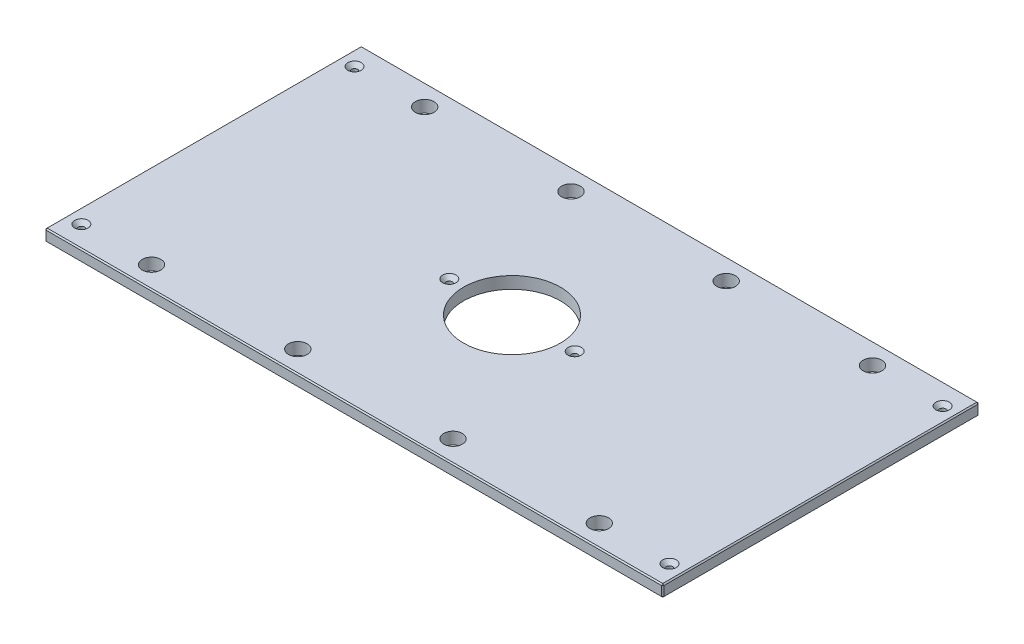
from build123d import *

# Parameters (mm, degrees)
SKETCH1_W                                        = 657.225
SKETCH1_H                                        = 336.55
BOSS_EXTRUDE1_DEPTH                              = 12.7
SKETCH13_R                                       = 51.562
CUT_EXTRUDE6_DEPTH                               = 370.410260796
F_25_32_0_78125_DIAMETER_HOLE1_D                 = 19.84375
CHAMFER2_SIZE                                    = 1.27
CSK_FOR_1_4_FLAT_HEAD_MACHINE_SCREW1_D           = 6.7564
CSK_FOR_1_4_FLAT_HEAD_MACHINE_SCREW1_CSINK_D     = 14.2748
CSK_FOR_1_4_FLAT_HEAD_MACHINE_SCREW1_CSINK_ANGLE = 82


with BuildPart() as part:
    # Sketch1 → Boss-Extrude1 (new body)
    with BuildSketch(Plane(origin=(0, 0, 0), x_dir=(1, 0, 0), z_dir=(0, 1, 0))):
        Rectangle(SKETCH1_W, SKETCH1_H)
    extrude(amount=BOSS_EXTRUDE1_DEPTH)

    # Sketch13 → Cut-Extrude6 (cut, through all)
    with BuildSketch(Plane(origin=(0, 12.7, 0), x_dir=(1, 0, 0), z_dir=(0, 1, 0))):
        with Locations(Location((0, 0, 0), (0, 0, 270))):
            Circle(SKETCH13_R)
    extrude(amount=-CUT_EXTRUDE6_DEPTH, mode=Mode.SUBTRACT)

    # 25_32 _0.78125_ Diameter Hole1 (through all)
    with Locations(Plane(origin=(0, 12.7, 0), x_dir=(1, 0, 0), z_dir=(0, 1, 0))):
        with Locations((238.125, 145.25498), (-238.125, 145.25498), (238.125, -145.25498), (-238.125, -145.25498), (-82.55, 145.25498), (82.55, 145.25498), (82.55, -145.25498), (-82.55, -145.25498)):
            Hole(F_25_32_0_78125_DIAMETER_HOLE1_D / 2)

    # Chamfer2
    chamfer2_edges = [part.edges().sort_by_distance(p)[0] for p in [
        (328.6125, 12.7, 0),
        (0, 12.7, -168.275),
        (-328.6125, 12.7, 0),
        (0, 0, -168.275),
        (328.6125, 0, 0),
        (0, 0, 168.275),
        (-328.6125, 0, 0),
        (0, 12.7, 168.275),
        (-328.6125, 6.35, -168.275),
        (328.6125, 6.35, -168.275),
        (328.6125, 6.35, 168.275),
        (-328.6125, 6.35, 168.275),
    ]]
    chamfer(chamfer2_edges, length=CHAMFER2_SIZE)

    # CSK for 1_4 Flat Head Machine Screw1 (through all)
    with Locations(Plane(origin=(0, 12.7, 0), x_dir=(1, 0, 0), z_dir=(0, 1, 0))):
        with Locations((312.7375, 145.25498), (312.7375, -145.25498), (-312.7375, -145.25498), (-66.675, 0), (66.675, 0), (-312.7375, 145.25498), (-238.125, 145.25498), (-238.125, -145.25498)):
            CounterSinkHole(CSK_FOR_1_4_FLAT_HEAD_MACHINE_SCREW1_D / 2, CSK_FOR_1_4_FLAT_HEAD_MACHINE_SCREW1_CSINK_D / 2, counter_sink_angle=CSK_FOR_1_4_FLAT_HEAD_MACHINE_SCREW1_CSINK_ANGLE)


solid = part.part
